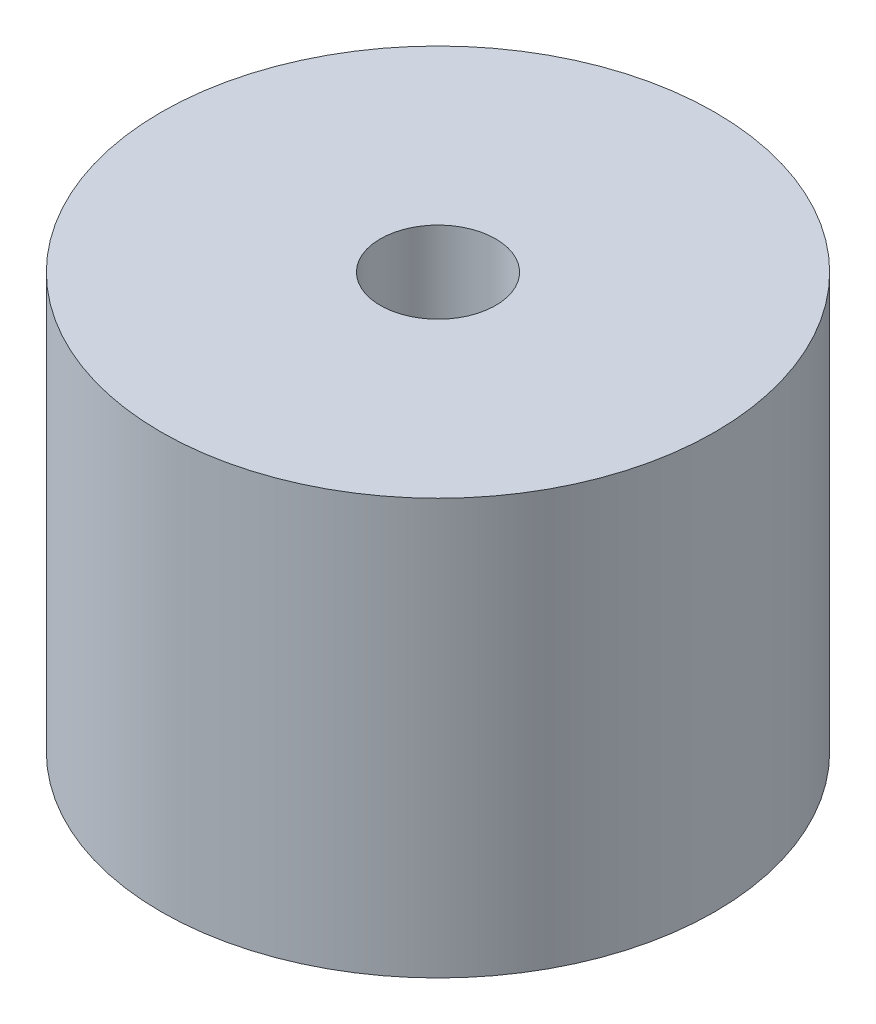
ISO-10303-21;
HEADER;
FILE_DESCRIPTION(('STEP AP214'),'2;1');
FILE_NAME('part.step','',(''),(''),'','','');
FILE_SCHEMA(('AUTOMOTIVE_DESIGN { 1 0 10303 214 1 1 1 1 }'));
ENDSEC;
DATA;
#1=APPLICATION_CONTEXT('core data for automotive mechanical design processes');
#2=APPLICATION_PROTOCOL_DEFINITION('international standard','automotive_design',2000,#1);
#3=PRODUCT_CONTEXT('',#1,'mechanical');
#4=PRODUCT('Part','Part','',(#3));
#5=PRODUCT_RELATED_PRODUCT_CATEGORY('part','',(#4));
#6=PRODUCT_DEFINITION_FORMATION('','',#4);
#7=PRODUCT_DEFINITION_CONTEXT('part definition',#1,'design');
#8=PRODUCT_DEFINITION('design','',#6,#7);
#9=PRODUCT_DEFINITION_SHAPE('','',#8);
#10=(LENGTH_UNIT() NAMED_UNIT(*) SI_UNIT(.MILLI.,.METRE.));
#11=(NAMED_UNIT(*) PLANE_ANGLE_UNIT() SI_UNIT($,.RADIAN.));
#12=(NAMED_UNIT(*) SI_UNIT($,.STERADIAN.) SOLID_ANGLE_UNIT());
#13=UNCERTAINTY_MEASURE_WITH_UNIT(LENGTH_MEASURE(1.E-05),#10,'distance_accuracy_value','');
#14=(GEOMETRIC_REPRESENTATION_CONTEXT(3) GLOBAL_UNCERTAINTY_ASSIGNED_CONTEXT((#13)) GLOBAL_UNIT_ASSIGNED_CONTEXT((#10,
#11,#12)) REPRESENTATION_CONTEXT('',''));
#15=CARTESIAN_POINT('',(0.,0.,0.));
#16=DIRECTION('',(0.,0.,1.));
#17=DIRECTION('',(1.,0.,0.));
#18=AXIS2_PLACEMENT_3D('',#15,#16,#17);
#19=CARTESIAN_POINT('',(0.,0.,0.));
#20=DIRECTION('',(0.,-1.,0.));
#21=DIRECTION('',(0.,0.,-1.));
#22=AXIS2_PLACEMENT_3D('',#19,#20,#21);
#23=CYLINDRICAL_SURFACE('',#22,0.625);
#24=CARTESIAN_POINT('',(0.,14.,0.));
#25=DIRECTION('',(0.,-1.,0.));
#26=DIRECTION('',(0.,0.,-1.));
#27=AXIS2_PLACEMENT_3D('',#24,#25,#26);
#28=CIRCLE('',#27,0.625);
#29=CARTESIAN_POINT('',(0.,14.,-0.625));
#30=VERTEX_POINT('',#29);
#31=EDGE_CURVE('E45',#30,#30,#28,.T.);
#32=ORIENTED_EDGE('',*,*,#31,.T.);
#33=EDGE_LOOP('',(#32));
#34=FACE_BOUND('',#33,.T.);
#35=CARTESIAN_POINT('',(0.,17.8064780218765,0.));
#36=DIRECTION('',(0.,-1.,0.));
#37=DIRECTION('',(0.,0.,-1.));
#38=AXIS2_PLACEMENT_3D('',#35,#36,#37);
#39=CIRCLE('',#38,0.625);
#40=CARTESIAN_POINT('',(0.,17.8064780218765,-0.625));
#41=VERTEX_POINT('',#40);
#42=EDGE_CURVE('E10',#41,#41,#39,.T.);
#43=ORIENTED_EDGE('',*,*,#42,.F.);
#44=EDGE_LOOP('',(#43));
#45=FACE_BOUND('',#44,.T.);
#46=ADVANCED_FACE('F31',(#34,#45),#23,.F.);
#47=CARTESIAN_POINT('',(0.625,17.8064780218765,0.));
#48=DIRECTION('',(0.,1.,0.));
#49=DIRECTION('',(0.,0.,1.));
#50=AXIS2_PLACEMENT_3D('',#47,#48,#49);
#51=PLANE('',#50);
#52=ORIENTED_EDGE('',*,*,#42,.T.);
#53=EDGE_LOOP('',(#52));
#54=FACE_BOUND('',#53,.T.);
#55=CARTESIAN_POINT('',(0.,17.8064780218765,0.));
#56=DIRECTION('',(0.,-1.,0.));
#57=DIRECTION('',(0.,0.,-1.));
#58=AXIS2_PLACEMENT_3D('',#55,#56,#57);
#59=CIRCLE('',#58,3.);
#60=CARTESIAN_POINT('',(0.,17.8064780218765,-3.));
#61=VERTEX_POINT('',#60);
#62=EDGE_CURVE('E37',#61,#61,#59,.T.);
#63=ORIENTED_EDGE('',*,*,#62,.F.);
#64=EDGE_LOOP('',(#63));
#65=FACE_BOUND('',#64,.T.);
#66=ADVANCED_FACE('F68',(#54,#65),#51,.T.);
#67=CARTESIAN_POINT('',(0.,0.,0.));
#68=DIRECTION('',(0.,-1.,0.));
#69=DIRECTION('',(0.,0.,-1.));
#70=AXIS2_PLACEMENT_3D('',#67,#68,#69);
#71=CYLINDRICAL_SURFACE('',#70,3.);
#72=ORIENTED_EDGE('',*,*,#62,.T.);
#73=EDGE_LOOP('',(#72));
#74=FACE_BOUND('',#73,.T.);
#75=CARTESIAN_POINT('',(0.,13.3064780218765,0.));
#76=DIRECTION('',(0.,-1.,0.));
#77=DIRECTION('',(0.,0.,-1.));
#78=AXIS2_PLACEMENT_3D('',#75,#76,#77);
#79=CIRCLE('',#78,3.);
#80=CARTESIAN_POINT('',(0.,13.3064780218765,-3.));
#81=VERTEX_POINT('',#80);
#82=EDGE_CURVE('E41',#81,#81,#79,.T.);
#83=ORIENTED_EDGE('',*,*,#82,.F.);
#84=EDGE_LOOP('',(#83));
#85=FACE_BOUND('',#84,.T.);
#86=ADVANCED_FACE('F63',(#74,#85),#71,.T.);
#87=CARTESIAN_POINT('',(3.,13.3064780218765,0.));
#88=DIRECTION('',(0.,-1.,0.));
#89=DIRECTION('',(0.,0.,-1.));
#90=AXIS2_PLACEMENT_3D('',#87,#88,#89);
#91=PLANE('',#90);
#92=CARTESIAN_POINT('',(2.,13.3064780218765,0.));
#93=DIRECTION('',(0.,-1.,0.));
#94=DIRECTION('',(0.,0.,-1.));
#95=AXIS2_PLACEMENT_3D('',#92,#93,#94);
#96=CIRCLE('',#95,0.5);
#97=CARTESIAN_POINT('',(2.,13.3064780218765,-0.5));
#98=VERTEX_POINT('',#97);
#99=EDGE_CURVE('E53',#98,#98,#96,.T.);
#100=ORIENTED_EDGE('',*,*,#99,.F.);
#101=EDGE_LOOP('',(#100));
#102=FACE_BOUND('',#101,.T.);
#103=ORIENTED_EDGE('',*,*,#82,.T.);
#104=EDGE_LOOP('',(#103));
#105=FACE_BOUND('',#104,.T.);
#106=ADVANCED_FACE('F59',(#102,#105),#91,.T.);
#107=CARTESIAN_POINT('',(0.,14.,0.));
#108=DIRECTION('',(0.,1.,0.));
#109=DIRECTION('',(0.,0.,1.));
#110=AXIS2_PLACEMENT_3D('',#107,#108,#109);
#111=PLANE('',#110);
#112=ORIENTED_EDGE('',*,*,#31,.F.);
#113=EDGE_LOOP('',(#112));
#114=FACE_BOUND('',#113,.T.);
#115=ADVANCED_FACE('F62',(#114),#111,.T.);
#116=CARTESIAN_POINT('',(2.,17.3064780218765,0.));
#117=DIRECTION('',(0.,-1.,0.));
#118=DIRECTION('',(0.,0.,-1.));
#119=AXIS2_PLACEMENT_3D('',#116,#117,#118);
#120=CYLINDRICAL_SURFACE('',#119,0.5);
#121=CARTESIAN_POINT('',(2.,17.3064780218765,0.));
#122=DIRECTION('',(0.,-1.,0.));
#123=DIRECTION('',(0.,0.,-1.));
#124=AXIS2_PLACEMENT_3D('',#121,#122,#123);
#125=CIRCLE('',#124,0.5);
#126=CARTESIAN_POINT('',(2.,17.3064780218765,-0.5));
#127=VERTEX_POINT('',#126);
#128=EDGE_CURVE('E50',#127,#127,#125,.T.);
#129=ORIENTED_EDGE('',*,*,#128,.F.);
#130=EDGE_LOOP('',(#129));
#131=FACE_BOUND('',#130,.T.);
#132=ORIENTED_EDGE('',*,*,#99,.T.);
#133=EDGE_LOOP('',(#132));
#134=FACE_BOUND('',#133,.T.);
#135=ADVANCED_FACE('F57',(#131,#134),#120,.F.);
#136=CARTESIAN_POINT('',(2.,17.3064780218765,0.));
#137=DIRECTION('',(0.,-1.,0.));
#138=DIRECTION('',(0.,0.,-1.));
#139=AXIS2_PLACEMENT_3D('',#136,#137,#138);
#140=PLANE('',#139);
#141=ORIENTED_EDGE('',*,*,#128,.T.);
#142=EDGE_LOOP('',(#141));
#143=FACE_BOUND('',#142,.T.);
#144=ADVANCED_FACE('F85',(#143),#140,.T.);
#145=CLOSED_SHELL('',(#46,#66,#86,#106,#115,#135,#144));
#146=MANIFOLD_SOLID_BREP('B2',#145);
#147=ADVANCED_BREP_SHAPE_REPRESENTATION('',(#18,#146),#14);
#148=SHAPE_DEFINITION_REPRESENTATION(#9,#147);
ENDSEC;
END-ISO-10303-21;
